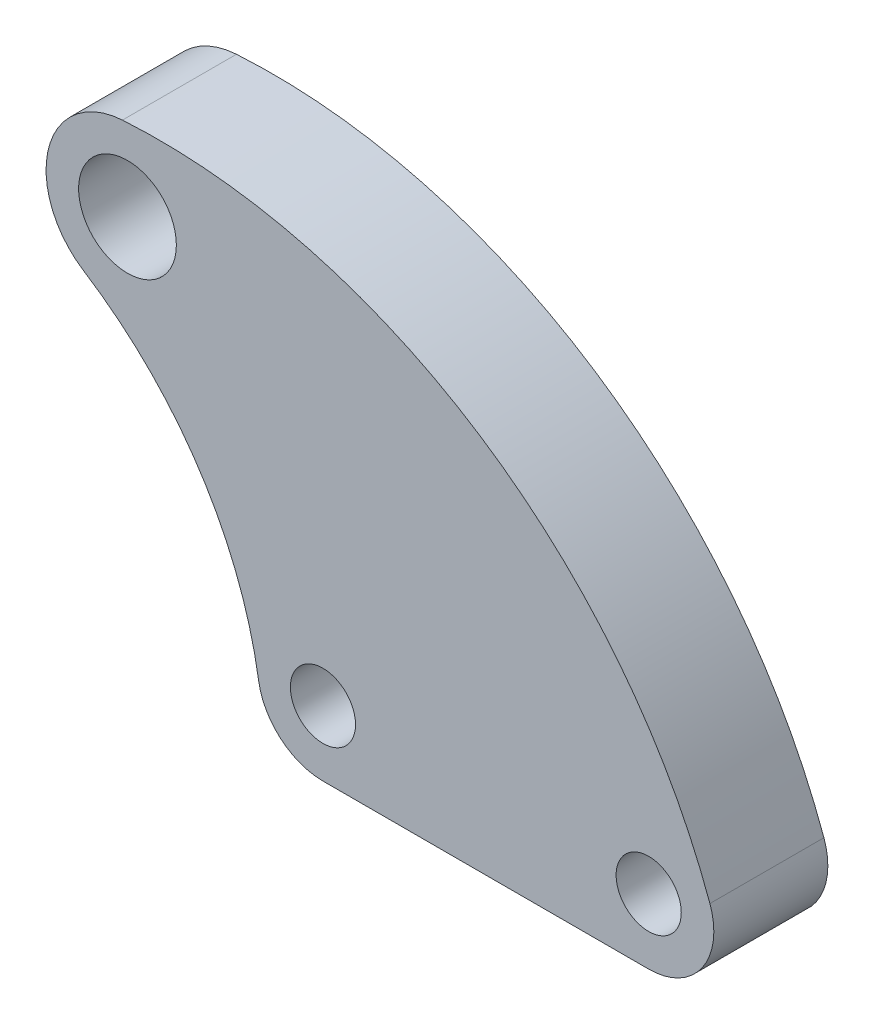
ISO-10303-21;
HEADER;
FILE_DESCRIPTION(('STEP AP214'),'2;1');
FILE_NAME('part.step','',(''),(''),'','','');
FILE_SCHEMA(('AUTOMOTIVE_DESIGN { 1 0 10303 214 1 1 1 1 }'));
ENDSEC;
DATA;
#1=APPLICATION_CONTEXT('core data for automotive mechanical design processes');
#2=APPLICATION_PROTOCOL_DEFINITION('international standard','automotive_design',2000,#1);
#3=PRODUCT_CONTEXT('',#1,'mechanical');
#4=PRODUCT('Part','Part','',(#3));
#5=PRODUCT_RELATED_PRODUCT_CATEGORY('part','',(#4));
#6=PRODUCT_DEFINITION_FORMATION('','',#4);
#7=PRODUCT_DEFINITION_CONTEXT('part definition',#1,'design');
#8=PRODUCT_DEFINITION('design','',#6,#7);
#9=PRODUCT_DEFINITION_SHAPE('','',#8);
#10=(LENGTH_UNIT() NAMED_UNIT(*) SI_UNIT(.MILLI.,.METRE.));
#11=(NAMED_UNIT(*) PLANE_ANGLE_UNIT() SI_UNIT($,.RADIAN.));
#12=(NAMED_UNIT(*) SI_UNIT($,.STERADIAN.) SOLID_ANGLE_UNIT());
#13=UNCERTAINTY_MEASURE_WITH_UNIT(LENGTH_MEASURE(1.E-05),#10,'distance_accuracy_value','');
#14=(GEOMETRIC_REPRESENTATION_CONTEXT(3) GLOBAL_UNCERTAINTY_ASSIGNED_CONTEXT((#13)) GLOBAL_UNIT_ASSIGNED_CONTEXT((#10,
#11,#12)) REPRESENTATION_CONTEXT('',''));
#15=CARTESIAN_POINT('',(0.,0.,0.));
#16=DIRECTION('',(0.,0.,1.));
#17=DIRECTION('',(1.,0.,0.));
#18=AXIS2_PLACEMENT_3D('',#15,#16,#17);
#19=CARTESIAN_POINT('',(-50.3593084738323,-54.6998935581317,17.5));
#20=DIRECTION('',(0.,0.,-1.));
#21=DIRECTION('',(-1.,0.,0.));
#22=AXIS2_PLACEMENT_3D('',#19,#20,#21);
#23=PLANE('',#22);
#24=CARTESIAN_POINT('',(-50.3593084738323,-54.6998935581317,17.5));
#25=DIRECTION('',(0.,0.,1.));
#26=DIRECTION('',(-1.,0.,0.));
#27=AXIS2_PLACEMENT_3D('',#24,#25,#26);
#28=CIRCLE('',#27,180.);
#29=CARTESIAN_POINT('',(118.794913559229,6.83748669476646,17.5));
#30=VERTEX_POINT('',#29);
#31=CARTESIAN_POINT('',(-61.5549502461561,124.951595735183,17.5));
#32=VERTEX_POINT('',#31);
#33=EDGE_CURVE('E130',#30,#32,#28,.T.);
#34=ORIENTED_EDGE('',*,*,#33,.T.);
#35=CARTESIAN_POINT('',(-60.,100.,17.5));
#36=DIRECTION('',(0.,0.,1.));
#37=DIRECTION('',(1.,0.,0.));
#38=AXIS2_PLACEMENT_3D('',#35,#36,#37);
#39=CIRCLE('',#38,25.);
#40=CARTESIAN_POINT('',(-73.4911698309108,78.952711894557,17.5));
#41=VERTEX_POINT('',#40);
#42=EDGE_CURVE('E88',#32,#41,#39,.T.);
#43=ORIENTED_EDGE('',*,*,#42,.T.);
#44=CARTESIAN_POINT('',(-138.248785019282,-22.0742710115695,17.5));
#45=DIRECTION('',(0.,0.,-1.));
#46=DIRECTION('',(-1.,0.,0.));
#47=AXIS2_PLACEMENT_3D('',#44,#45,#46);
#48=CIRCLE('',#47,120.);
#49=CARTESIAN_POINT('',(-19.7498264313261,-3.15346728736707,17.5));
#50=VERTEX_POINT('',#49);
#51=EDGE_CURVE('E101',#41,#50,#48,.T.);
#52=ORIENTED_EDGE('',*,*,#51,.T.);
#53=CARTESIAN_POINT('',(0.,0.,17.5));
#54=DIRECTION('',(0.,0.,1.));
#55=DIRECTION('',(1.,0.,0.));
#56=AXIS2_PLACEMENT_3D('',#53,#54,#55);
#57=CIRCLE('',#56,20.);
#58=CARTESIAN_POINT('',(0.,-20.,17.5));
#59=VERTEX_POINT('',#58);
#60=EDGE_CURVE('E95',#50,#59,#57,.T.);
#61=ORIENTED_EDGE('',*,*,#60,.T.);
#62=DIRECTION('',(1.,0.,0.));
#63=VECTOR('',#62,1.);
#64=CARTESIAN_POINT('',(0.,-20.,17.5));
#65=LINE('',#64,#63);
#66=CARTESIAN_POINT('',(100.,-20.,17.5));
#67=VERTEX_POINT('',#66);
#68=EDGE_CURVE('E99',#59,#67,#65,.T.);
#69=ORIENTED_EDGE('',*,*,#68,.T.);
#70=CARTESIAN_POINT('',(100.,0.,17.5));
#71=DIRECTION('',(0.,0.,1.));
#72=DIRECTION('',(1.,0.,0.));
#73=AXIS2_PLACEMENT_3D('',#70,#71,#72);
#74=CIRCLE('',#73,20.);
#75=EDGE_CURVE('E51',#67,#30,#74,.T.);
#76=ORIENTED_EDGE('',*,*,#75,.T.);
#77=EDGE_LOOP('',(#34,#43,#52,#61,#69,#76));
#78=FACE_BOUND('',#77,.T.);
#79=CARTESIAN_POINT('',(0.,0.,17.5));
#80=DIRECTION('',(0.,0.,1.));
#81=DIRECTION('',(1.,0.,0.));
#82=AXIS2_PLACEMENT_3D('',#79,#80,#81);
#83=CIRCLE('',#82,10.);
#84=CARTESIAN_POINT('',(10.,0.,17.5));
#85=VERTEX_POINT('',#84);
#86=EDGE_CURVE('E123',#85,#85,#83,.T.);
#87=ORIENTED_EDGE('',*,*,#86,.F.);
#88=EDGE_LOOP('',(#87));
#89=FACE_BOUND('',#88,.T.);
#90=CARTESIAN_POINT('',(100.,0.,17.5));
#91=DIRECTION('',(0.,0.,1.));
#92=DIRECTION('',(1.,0.,0.));
#93=AXIS2_PLACEMENT_3D('',#90,#91,#92);
#94=CIRCLE('',#93,9.99999999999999);
#95=CARTESIAN_POINT('',(110.,0.,17.5));
#96=VERTEX_POINT('',#95);
#97=EDGE_CURVE('E184',#96,#96,#94,.T.);
#98=ORIENTED_EDGE('',*,*,#97,.F.);
#99=EDGE_LOOP('',(#98));
#100=FACE_BOUND('',#99,.T.);
#101=CARTESIAN_POINT('',(-60.,100.,17.5));
#102=DIRECTION('',(0.,0.,1.));
#103=DIRECTION('',(1.,0.,0.));
#104=AXIS2_PLACEMENT_3D('',#101,#102,#103);
#105=CIRCLE('',#104,15.);
#106=CARTESIAN_POINT('',(-45.,100.,17.5));
#107=VERTEX_POINT('',#106);
#108=EDGE_CURVE('E175',#107,#107,#105,.T.);
#109=ORIENTED_EDGE('',*,*,#108,.F.);
#110=EDGE_LOOP('',(#109));
#111=FACE_BOUND('',#110,.T.);
#112=ADVANCED_FACE('F34',(#78,#89,#100,#111),#23,.F.);
#113=CARTESIAN_POINT('',(-50.3593084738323,-54.6998935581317,-17.5));
#114=DIRECTION('',(0.,0.,-1.));
#115=DIRECTION('',(-1.,0.,0.));
#116=AXIS2_PLACEMENT_3D('',#113,#114,#115);
#117=PLANE('',#116);
#118=CARTESIAN_POINT('',(100.,0.,-17.5));
#119=DIRECTION('',(0.,0.,1.));
#120=DIRECTION('',(1.,0.,0.));
#121=AXIS2_PLACEMENT_3D('',#118,#119,#120);
#122=CIRCLE('',#121,9.99999999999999);
#123=CARTESIAN_POINT('',(110.,0.,-17.5));
#124=VERTEX_POINT('',#123);
#125=EDGE_CURVE('E181',#124,#124,#122,.T.);
#126=ORIENTED_EDGE('',*,*,#125,.T.);
#127=EDGE_LOOP('',(#126));
#128=FACE_BOUND('',#127,.T.);
#129=CARTESIAN_POINT('',(-50.3593084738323,-54.6998935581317,-17.5));
#130=DIRECTION('',(0.,0.,1.));
#131=DIRECTION('',(-1.,0.,0.));
#132=AXIS2_PLACEMENT_3D('',#129,#130,#131);
#133=CIRCLE('',#132,180.);
#134=CARTESIAN_POINT('',(118.794913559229,6.83748669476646,-17.5));
#135=VERTEX_POINT('',#134);
#136=CARTESIAN_POINT('',(-61.5549502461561,124.951595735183,-17.5));
#137=VERTEX_POINT('',#136);
#138=EDGE_CURVE('E119',#135,#137,#133,.T.);
#139=ORIENTED_EDGE('',*,*,#138,.F.);
#140=CARTESIAN_POINT('',(100.,0.,-17.5));
#141=DIRECTION('',(0.,0.,1.));
#142=DIRECTION('',(1.,0.,0.));
#143=AXIS2_PLACEMENT_3D('',#140,#141,#142);
#144=CIRCLE('',#143,20.);
#145=CARTESIAN_POINT('',(100.,-20.,-17.5));
#146=VERTEX_POINT('',#145);
#147=EDGE_CURVE('E80',#146,#135,#144,.T.);
#148=ORIENTED_EDGE('',*,*,#147,.F.);
#149=DIRECTION('',(1.,0.,0.));
#150=VECTOR('',#149,1.);
#151=CARTESIAN_POINT('',(0.,-20.,-17.5));
#152=LINE('',#151,#150);
#153=CARTESIAN_POINT('',(0.,-20.,-17.5));
#154=VERTEX_POINT('',#153);
#155=EDGE_CURVE('E74',#154,#146,#152,.T.);
#156=ORIENTED_EDGE('',*,*,#155,.F.);
#157=CARTESIAN_POINT('',(0.,0.,-17.5));
#158=DIRECTION('',(0.,0.,1.));
#159=DIRECTION('',(1.,0.,0.));
#160=AXIS2_PLACEMENT_3D('',#157,#158,#159);
#161=CIRCLE('',#160,20.);
#162=CARTESIAN_POINT('',(-19.7498264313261,-3.15346728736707,-17.5));
#163=VERTEX_POINT('',#162);
#164=EDGE_CURVE('E109',#163,#154,#161,.T.);
#165=ORIENTED_EDGE('',*,*,#164,.F.);
#166=CARTESIAN_POINT('',(-138.248785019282,-22.0742710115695,-17.5));
#167=DIRECTION('',(0.,0.,-1.));
#168=DIRECTION('',(-1.,0.,0.));
#169=AXIS2_PLACEMENT_3D('',#166,#167,#168);
#170=CIRCLE('',#169,120.);
#171=CARTESIAN_POINT('',(-73.4911698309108,78.952711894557,-17.5));
#172=VERTEX_POINT('',#171);
#173=EDGE_CURVE('E125',#172,#163,#170,.T.);
#174=ORIENTED_EDGE('',*,*,#173,.F.);
#175=CARTESIAN_POINT('',(-60.,100.,-17.5));
#176=DIRECTION('',(0.,0.,1.));
#177=DIRECTION('',(1.,0.,0.));
#178=AXIS2_PLACEMENT_3D('',#175,#176,#177);
#179=CIRCLE('',#178,25.);
#180=EDGE_CURVE('E122',#137,#172,#179,.T.);
#181=ORIENTED_EDGE('',*,*,#180,.F.);
#182=EDGE_LOOP('',(#139,#148,#156,#165,#174,#181));
#183=FACE_BOUND('',#182,.T.);
#184=CARTESIAN_POINT('',(0.,0.,-17.5));
#185=DIRECTION('',(0.,0.,1.));
#186=DIRECTION('',(1.,0.,0.));
#187=AXIS2_PLACEMENT_3D('',#184,#185,#186);
#188=CIRCLE('',#187,10.);
#189=CARTESIAN_POINT('',(10.,0.,-17.5));
#190=VERTEX_POINT('',#189);
#191=EDGE_CURVE('E187',#190,#190,#188,.T.);
#192=ORIENTED_EDGE('',*,*,#191,.T.);
#193=EDGE_LOOP('',(#192));
#194=FACE_BOUND('',#193,.T.);
#195=CARTESIAN_POINT('',(-60.,100.,-17.5));
#196=DIRECTION('',(0.,0.,1.));
#197=DIRECTION('',(1.,0.,0.));
#198=AXIS2_PLACEMENT_3D('',#195,#196,#197);
#199=CIRCLE('',#198,15.);
#200=CARTESIAN_POINT('',(-45.,100.,-17.5));
#201=VERTEX_POINT('',#200);
#202=EDGE_CURVE('E178',#201,#201,#199,.T.);
#203=ORIENTED_EDGE('',*,*,#202,.T.);
#204=EDGE_LOOP('',(#203));
#205=FACE_BOUND('',#204,.T.);
#206=ADVANCED_FACE('F139',(#128,#183,#194,#205),#117,.T.);
#207=CARTESIAN_POINT('',(-50.3593084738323,-54.6998935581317,17.5));
#208=DIRECTION('',(0.,0.,-1.));
#209=DIRECTION('',(-1.,0.,0.));
#210=AXIS2_PLACEMENT_3D('',#207,#208,#209);
#211=CYLINDRICAL_SURFACE('',#210,180.);
#212=ORIENTED_EDGE('',*,*,#138,.T.);
#213=DIRECTION('',(0.,0.,-1.));
#214=VECTOR('',#213,1.);
#215=CARTESIAN_POINT('',(-61.5549502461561,124.951595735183,17.5));
#216=LINE('',#215,#214);
#217=EDGE_CURVE('E11',#32,#137,#216,.T.);
#218=ORIENTED_EDGE('',*,*,#217,.F.);
#219=ORIENTED_EDGE('',*,*,#33,.F.);
#220=DIRECTION('',(0.,0.,-1.));
#221=VECTOR('',#220,1.);
#222=CARTESIAN_POINT('',(118.794913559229,6.83748669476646,17.5));
#223=LINE('',#222,#221);
#224=EDGE_CURVE('E115',#30,#135,#223,.T.);
#225=ORIENTED_EDGE('',*,*,#224,.T.);
#226=EDGE_LOOP('',(#212,#218,#219,#225));
#227=FACE_BOUND('',#226,.T.);
#228=ADVANCED_FACE('F36',(#227),#211,.T.);
#229=CARTESIAN_POINT('',(-60.,100.,17.5));
#230=DIRECTION('',(0.,0.,-1.));
#231=DIRECTION('',(-1.,0.,0.));
#232=AXIS2_PLACEMENT_3D('',#229,#230,#231);
#233=CYLINDRICAL_SURFACE('',#232,25.);
#234=ORIENTED_EDGE('',*,*,#180,.T.);
#235=DIRECTION('',(0.,0.,-1.));
#236=VECTOR('',#235,1.);
#237=CARTESIAN_POINT('',(-73.4911698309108,78.952711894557,17.5));
#238=LINE('',#237,#236);
#239=EDGE_CURVE('E43',#41,#172,#238,.T.);
#240=ORIENTED_EDGE('',*,*,#239,.F.);
#241=ORIENTED_EDGE('',*,*,#42,.F.);
#242=ORIENTED_EDGE('',*,*,#217,.T.);
#243=EDGE_LOOP('',(#234,#240,#241,#242));
#244=FACE_BOUND('',#243,.T.);
#245=ADVANCED_FACE('F238',(#244),#233,.T.);
#246=CARTESIAN_POINT('',(-138.248785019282,-22.0742710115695,17.5));
#247=DIRECTION('',(0.,0.,-1.));
#248=DIRECTION('',(-1.,0.,0.));
#249=AXIS2_PLACEMENT_3D('',#246,#247,#248);
#250=CYLINDRICAL_SURFACE('',#249,120.);
#251=ORIENTED_EDGE('',*,*,#173,.T.);
#252=DIRECTION('',(0.,0.,-1.));
#253=VECTOR('',#252,1.);
#254=CARTESIAN_POINT('',(-19.7498264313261,-3.15346728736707,17.5));
#255=LINE('',#254,#253);
#256=EDGE_CURVE('E110',#50,#163,#255,.T.);
#257=ORIENTED_EDGE('',*,*,#256,.F.);
#258=ORIENTED_EDGE('',*,*,#51,.F.);
#259=ORIENTED_EDGE('',*,*,#239,.T.);
#260=EDGE_LOOP('',(#251,#257,#258,#259));
#261=FACE_BOUND('',#260,.T.);
#262=ADVANCED_FACE('F136',(#261),#250,.F.);
#263=CARTESIAN_POINT('',(0.,0.,17.5));
#264=DIRECTION('',(0.,0.,-1.));
#265=DIRECTION('',(-1.,0.,0.));
#266=AXIS2_PLACEMENT_3D('',#263,#264,#265);
#267=CYLINDRICAL_SURFACE('',#266,20.);
#268=ORIENTED_EDGE('',*,*,#164,.T.);
#269=DIRECTION('',(0.,0.,-1.));
#270=VECTOR('',#269,1.);
#271=CARTESIAN_POINT('',(0.,-20.,17.5));
#272=LINE('',#271,#270);
#273=EDGE_CURVE('E106',#59,#154,#272,.T.);
#274=ORIENTED_EDGE('',*,*,#273,.F.);
#275=ORIENTED_EDGE('',*,*,#60,.F.);
#276=ORIENTED_EDGE('',*,*,#256,.T.);
#277=EDGE_LOOP('',(#268,#274,#275,#276));
#278=FACE_BOUND('',#277,.T.);
#279=ADVANCED_FACE('F107',(#278),#267,.T.);
#280=CARTESIAN_POINT('',(0.,-20.,17.5));
#281=DIRECTION('',(0.,1.,0.));
#282=DIRECTION('',(0.,0.,1.));
#283=AXIS2_PLACEMENT_3D('',#280,#281,#282);
#284=PLANE('',#283);
#285=ORIENTED_EDGE('',*,*,#155,.T.);
#286=DIRECTION('',(0.,0.,-1.));
#287=VECTOR('',#286,1.);
#288=CARTESIAN_POINT('',(100.,-20.,17.5));
#289=LINE('',#288,#287);
#290=EDGE_CURVE('E111',#67,#146,#289,.T.);
#291=ORIENTED_EDGE('',*,*,#290,.F.);
#292=ORIENTED_EDGE('',*,*,#68,.F.);
#293=ORIENTED_EDGE('',*,*,#273,.T.);
#294=EDGE_LOOP('',(#285,#291,#292,#293));
#295=FACE_BOUND('',#294,.T.);
#296=ADVANCED_FACE('F113',(#295),#284,.F.);
#297=CARTESIAN_POINT('',(100.,0.,17.5));
#298=DIRECTION('',(0.,0.,-1.));
#299=DIRECTION('',(-1.,0.,0.));
#300=AXIS2_PLACEMENT_3D('',#297,#298,#299);
#301=CYLINDRICAL_SURFACE('',#300,20.);
#302=ORIENTED_EDGE('',*,*,#147,.T.);
#303=ORIENTED_EDGE('',*,*,#224,.F.);
#304=ORIENTED_EDGE('',*,*,#75,.F.);
#305=ORIENTED_EDGE('',*,*,#290,.T.);
#306=EDGE_LOOP('',(#302,#303,#304,#305));
#307=FACE_BOUND('',#306,.T.);
#308=ADVANCED_FACE('F144',(#307),#301,.T.);
#309=CARTESIAN_POINT('',(0.,0.,17.5));
#310=DIRECTION('',(0.,0.,-1.));
#311=DIRECTION('',(-1.,0.,0.));
#312=AXIS2_PLACEMENT_3D('',#309,#310,#311);
#313=CYLINDRICAL_SURFACE('',#312,10.);
#314=ORIENTED_EDGE('',*,*,#86,.T.);
#315=EDGE_LOOP('',(#314));
#316=FACE_BOUND('',#315,.T.);
#317=ORIENTED_EDGE('',*,*,#191,.F.);
#318=EDGE_LOOP('',(#317));
#319=FACE_BOUND('',#318,.T.);
#320=ADVANCED_FACE('F146',(#316,#319),#313,.F.);
#321=CARTESIAN_POINT('',(100.,0.,17.5));
#322=DIRECTION('',(0.,0.,-1.));
#323=DIRECTION('',(-1.,0.,0.));
#324=AXIS2_PLACEMENT_3D('',#321,#322,#323);
#325=CYLINDRICAL_SURFACE('',#324,9.99999999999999);
#326=ORIENTED_EDGE('',*,*,#97,.T.);
#327=EDGE_LOOP('',(#326));
#328=FACE_BOUND('',#327,.T.);
#329=ORIENTED_EDGE('',*,*,#125,.F.);
#330=EDGE_LOOP('',(#329));
#331=FACE_BOUND('',#330,.T.);
#332=ADVANCED_FACE('F152',(#328,#331),#325,.F.);
#333=CARTESIAN_POINT('',(-60.,100.,17.5));
#334=DIRECTION('',(0.,0.,-1.));
#335=DIRECTION('',(-1.,0.,0.));
#336=AXIS2_PLACEMENT_3D('',#333,#334,#335);
#337=CYLINDRICAL_SURFACE('',#336,15.);
#338=ORIENTED_EDGE('',*,*,#108,.T.);
#339=EDGE_LOOP('',(#338));
#340=FACE_BOUND('',#339,.T.);
#341=ORIENTED_EDGE('',*,*,#202,.F.);
#342=EDGE_LOOP('',(#341));
#343=FACE_BOUND('',#342,.T.);
#344=ADVANCED_FACE('F166',(#340,#343),#337,.F.);
#345=CLOSED_SHELL('',(#112,#206,#228,#245,#262,#279,#296,#308,#320,#332,#344));
#346=MANIFOLD_SOLID_BREP('B2',#345);
#347=ADVANCED_BREP_SHAPE_REPRESENTATION('',(#18,#346),#14);
#348=SHAPE_DEFINITION_REPRESENTATION(#9,#347);
ENDSEC;
END-ISO-10303-21;
